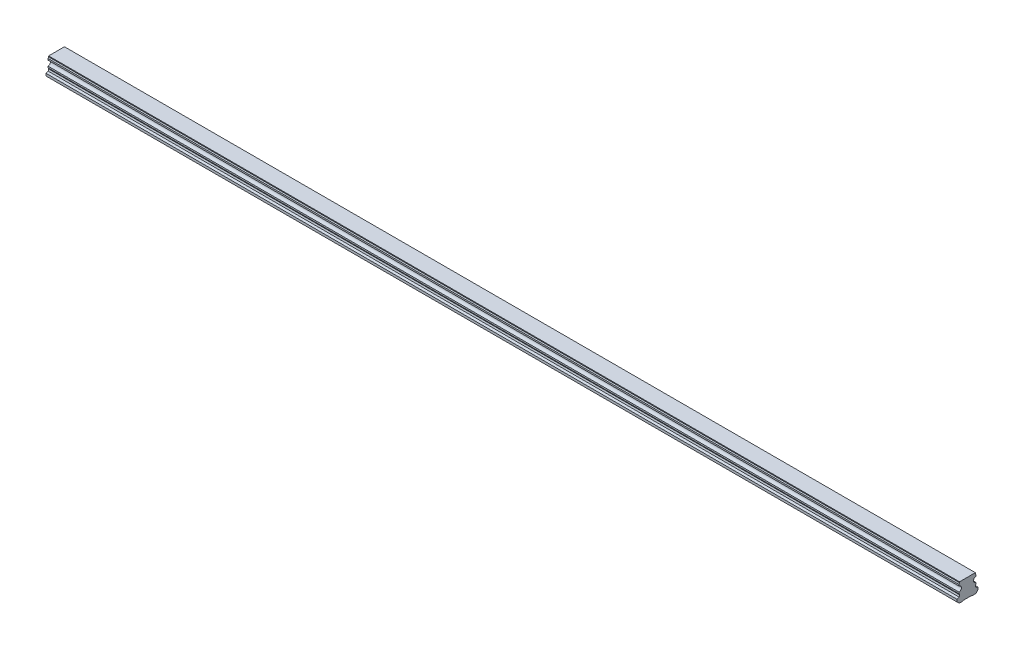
from build123d import *

# Parameters (mm, degrees)
BOSS_EXTRUDE1_DEPTH        = 1080
SKETCH3_R                  = 3
SKETCH3_R_2                = 2.5
CUT_EXTRUDE3_DEPTH         = 12
SKETCH3_2_R                = 2.5
CUT_EXTRUDE4_DEPTH         = 15
CHAMFER1_SIZE              = 0.5
LPATTERN4_COUNT            = 18
LPATTERN4_PITCH            = 60
CHAMFER1_OF_LPATTERN4_SIZE = 0.5


with BuildPart() as part:
    # Sketch1 → Boss-Extrude1 (new body)
    with BuildSketch(Plane(origin=(0, 0, 0), x_dir=(0, 0, -1), z_dir=(1, 0, 0))):
        with BuildLine():
            Line((9.375, 21.8), (-9.375, 21.8))
            Line((-9.375, 21.8), (-9.375, 20.756))
            Line((-9.375, 20.756), (-10, 19.415683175))
            Line((-10, 19.415683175), (-10, 17.685449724))
            ThreePointArc((-10, 17.685449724), (-7.2, 14.6), (-10, 11.514550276))
            Line((-10, 11.514550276), (-10, 9.784316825))
            Line((-10, 9.784316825), (-9.375, 8.444))
            Line((-9.375, 8.444), (-9.922688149, 6.4))
            Line((-9.922688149, 6.4), (-12.5, 5.489338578))
            Line((-12.5, 5.489338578), (-12.5, 2.65))
            Line((-12.5, 2.65), (-9.85, 0))
            Line((-9.85, 0), (-5.5, 0))
            Line((-5.5, 0), (-5, 0.5))
            Line((-5, 0.5), (5, 0.5))
            Line((5, 0.5), (5.5, 0))
            Line((5.5, 0), (9.85, 0))
            Line((9.85, 0), (12.5, 2.65))
            Line((12.5, 2.65), (12.5, 5.489338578))
            Line((12.5, 5.489338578), (9.922688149, 6.4))
            Line((9.922688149, 6.4), (9.375, 8.444))
            Line((9.375, 8.444), (10, 9.784316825))
            Line((10, 9.784316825), (10, 11.514550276))
            ThreePointArc((10, 11.514550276), (7.2, 14.6), (10, 17.685449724))
            Line((10, 17.685449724), (10, 19.415683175))
            Line((10, 19.415683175), (9.375, 20.756))
            Line((9.375, 20.756), (9.375, 21.8))
        make_face()
    extrude(amount=BOSS_EXTRUDE1_DEPTH)

    # Sketch3 → Cut-Extrude3 (cut)
    with BuildSketch(Plane.XZ):
        with Locations(Location((30, 0, 0), (0, 0, 270))):
            Circle(SKETCH3_R)
        with Locations(Location((30, 0, 0), (0, 0, 270))):
            Circle(SKETCH3_R_2, mode=Mode.SUBTRACT)
    cut_extrude3 = extrude(amount=-CUT_EXTRUDE3_DEPTH, mode=Mode.SUBTRACT)

    # Sketch3_2 → Cut-Extrude4 (cut)
    with BuildSketch(Plane.XZ):
        with Locations(Location((30, 0, 0), (0, 0, 270))):
            Circle(SKETCH3_2_R)
    cut_extrude4 = extrude(amount=-CUT_EXTRUDE4_DEPTH, mode=Mode.SUBTRACT)

    # Cut-Extrude5 cone 1 section (on through the dimple's axis) → Cut-Extrude5 (revolve, cut)
    with BuildSketch(Plane(origin=(30, 15, 0), x_dir=(0, 0, -1), z_dir=(1, 0, 0))):
        Polygon((0, 0), (2.5, 0), (0, 1.443375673), align=None)
    cut_extrude5 = revolve(axis=Axis((30, 15, 0), (0, 1, 0)), mode=Mode.SUBTRACT)

    # Chamfer1
    chamfer1_edges = [part.edges().sort_by_distance(p)[0] for p in [
        (30, 0.5, 3),
    ]]
    chamfer(chamfer1_edges, length=CHAMFER1_SIZE)

    # LPattern4: Cut-Extrude3, Cut-Extrude4, Cut-Extrude5 ×18
    with Locations(*[(i * LPATTERN4_PITCH, 0, 0) for i in range(1, LPATTERN4_COUNT)]):
        add(cut_extrude3, mode=Mode.SUBTRACT)
        add(cut_extrude4, mode=Mode.SUBTRACT)
        add(cut_extrude5, mode=Mode.SUBTRACT)

    # Chamfer1 of LPattern4
    chamfer1_of_lpattern4_edges = [part.edges().sort_by_distance(p)[0] for p in [
        (90, 0.5, 3),
        (150, 0.5, 3),
        (210, 0.5, 3),
        (270, 0.5, 3),
        (330, 0.5, 3),
        (390, 0.5, 3),
        (450, 0.5, 3),
        (510, 0.5, 3),
        (570, 0.5, 3),
        (630, 0.5, 3),
        (690, 0.5, 3),
        (750, 0.5, 3),
        (810, 0.5, 3),
        (870, 0.5, 3),
        (930, 0.5, 3),
        (990, 0.5, 3),
        (1050, 0.5, 3),
    ]]
    chamfer(chamfer1_of_lpattern4_edges, length=CHAMFER1_OF_LPATTERN4_SIZE)


solid = part.part
